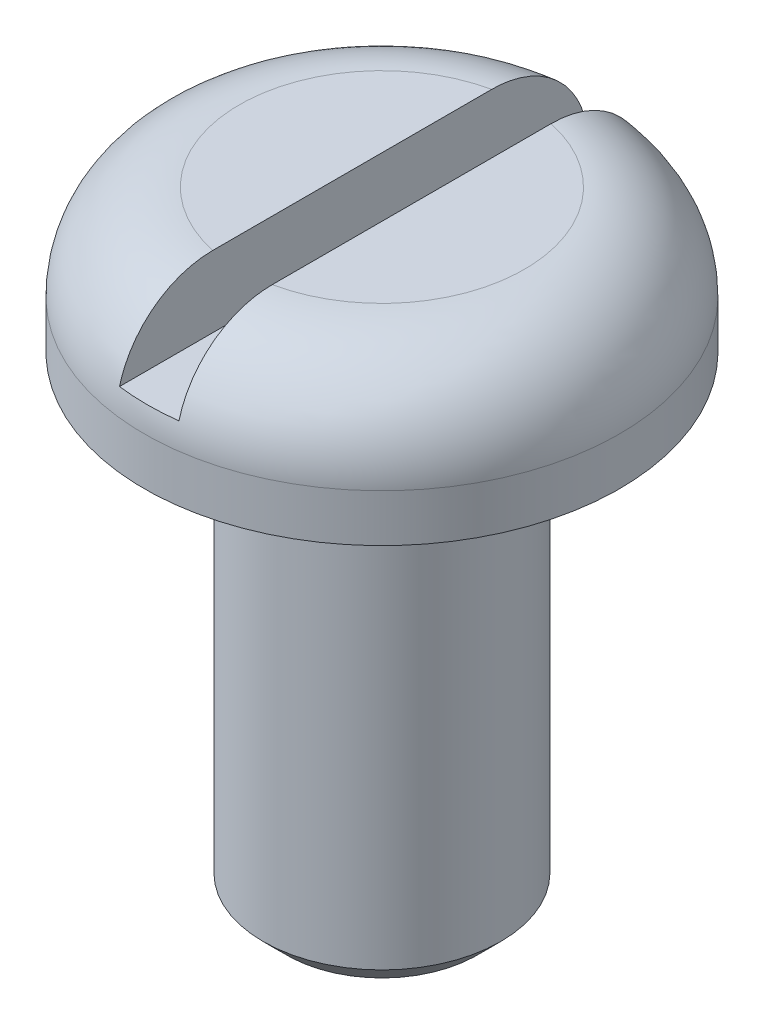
ISO-10303-21;
HEADER;
FILE_DESCRIPTION(('STEP AP214'),'2;1');
FILE_NAME('part.step','',(''),(''),'','','');
FILE_SCHEMA(('AUTOMOTIVE_DESIGN { 1 0 10303 214 1 1 1 1 }'));
ENDSEC;
DATA;
#1=APPLICATION_CONTEXT('core data for automotive mechanical design processes');
#2=APPLICATION_PROTOCOL_DEFINITION('international standard','automotive_design',2000,#1);
#3=PRODUCT_CONTEXT('',#1,'mechanical');
#4=PRODUCT('Part','Part','',(#3));
#5=PRODUCT_RELATED_PRODUCT_CATEGORY('part','',(#4));
#6=PRODUCT_DEFINITION_FORMATION('','',#4);
#7=PRODUCT_DEFINITION_CONTEXT('part definition',#1,'design');
#8=PRODUCT_DEFINITION('design','',#6,#7);
#9=PRODUCT_DEFINITION_SHAPE('','',#8);
#10=(LENGTH_UNIT() NAMED_UNIT(*) SI_UNIT(.MILLI.,.METRE.));
#11=(NAMED_UNIT(*) PLANE_ANGLE_UNIT() SI_UNIT($,.RADIAN.));
#12=(NAMED_UNIT(*) SI_UNIT($,.STERADIAN.) SOLID_ANGLE_UNIT());
#13=UNCERTAINTY_MEASURE_WITH_UNIT(LENGTH_MEASURE(1.E-05),#10,'distance_accuracy_value','');
#14=(GEOMETRIC_REPRESENTATION_CONTEXT(3) GLOBAL_UNCERTAINTY_ASSIGNED_CONTEXT((#13)) GLOBAL_UNIT_ASSIGNED_CONTEXT((#10,
#11,#12)) REPRESENTATION_CONTEXT('',''));
#15=CARTESIAN_POINT('',(0.,0.,0.));
#16=DIRECTION('',(0.,0.,1.));
#17=DIRECTION('',(1.,0.,0.));
#18=AXIS2_PLACEMENT_3D('',#15,#16,#17);
#19=CARTESIAN_POINT('',(0.,-4.,0.));
#20=DIRECTION('',(0.,1.,0.));
#21=DIRECTION('',(0.,0.,1.));
#22=AXIS2_PLACEMENT_3D('',#19,#20,#21);
#23=CYLINDRICAL_SURFACE('',#22,1.);
#24=CARTESIAN_POINT('',(0.,0.,0.));
#25=DIRECTION('',(0.,-1.,0.));
#26=DIRECTION('',(0.,0.,-1.));
#27=AXIS2_PLACEMENT_3D('',#24,#25,#26);
#28=CIRCLE('',#27,1.);
#29=CARTESIAN_POINT('',(0.,0.,-1.));
#30=VERTEX_POINT('',#29);
#31=EDGE_CURVE('E90',#30,#30,#28,.T.);
#32=ORIENTED_EDGE('',*,*,#31,.T.);
#33=EDGE_LOOP('',(#32));
#34=FACE_BOUND('',#33,.T.);
#35=CARTESIAN_POINT('',(0.,-3.8,0.));
#36=DIRECTION('',(0.,1.,0.));
#37=DIRECTION('',(0.,0.,1.));
#38=AXIS2_PLACEMENT_3D('',#35,#36,#37);
#39=CIRCLE('',#38,1.);
#40=CARTESIAN_POINT('',(0.,-3.8,1.));
#41=VERTEX_POINT('',#40);
#42=EDGE_CURVE('E169',#41,#41,#39,.F.);
#43=ORIENTED_EDGE('',*,*,#42,.F.);
#44=EDGE_LOOP('',(#43));
#45=FACE_BOUND('',#44,.T.);
#46=ADVANCED_FACE('F35',(#34,#45),#23,.T.);
#47=CARTESIAN_POINT('',(0.,1.2,0.));
#48=DIRECTION('',(0.,1.,0.));
#49=DIRECTION('',(0.,0.,1.));
#50=AXIS2_PLACEMENT_3D('',#47,#48,#49);
#51=PLANE('',#50);
#52=DIRECTION('',(0.,0.,1.));
#53=VECTOR('',#52,1.);
#54=CARTESIAN_POINT('',(-0.25,1.2,-2.92696320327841));
#55=LINE('',#54,#53);
#56=CARTESIAN_POINT('',(-0.25,1.2,-1.17366945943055));
#57=VERTEX_POINT('',#56);
#58=CARTESIAN_POINT('',(-0.25,1.2,1.17366945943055));
#59=VERTEX_POINT('',#58);
#60=EDGE_CURVE('E80',#57,#59,#55,.T.);
#61=ORIENTED_EDGE('',*,*,#60,.F.);
#62=CARTESIAN_POINT('',(0.,1.2,0.));
#63=DIRECTION('',(0.,-1.,0.));
#64=DIRECTION('',(0.,0.,-1.));
#65=AXIS2_PLACEMENT_3D('',#62,#63,#64);
#66=CIRCLE('',#65,1.19999999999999);
#67=EDGE_CURVE('E88',#59,#57,#66,.T.);
#68=ORIENTED_EDGE('',*,*,#67,.F.);
#69=EDGE_LOOP('',(#61,#68));
#70=FACE_BOUND('',#69,.T.);
#71=ADVANCED_FACE('F87',(#70),#51,.T.);
#72=CARTESIAN_POINT('',(0.,0.,0.));
#73=DIRECTION('',(0.,-1.,0.));
#74=DIRECTION('',(0.,0.,-1.));
#75=AXIS2_PLACEMENT_3D('',#72,#73,#74);
#76=PLANE('',#75);
#77=ORIENTED_EDGE('',*,*,#31,.F.);
#78=EDGE_LOOP('',(#77));
#79=FACE_BOUND('',#78,.T.);
#80=CARTESIAN_POINT('',(0.,0.,0.));
#81=DIRECTION('',(0.,-1.,0.));
#82=DIRECTION('',(0.,0.,-1.));
#83=AXIS2_PLACEMENT_3D('',#80,#81,#82);
#84=CIRCLE('',#83,2.);
#85=CARTESIAN_POINT('',(0.,0.,-2.));
#86=VERTEX_POINT('',#85);
#87=EDGE_CURVE('E102',#86,#86,#84,.T.);
#88=ORIENTED_EDGE('',*,*,#87,.T.);
#89=EDGE_LOOP('',(#88));
#90=FACE_BOUND('',#89,.T.);
#91=ADVANCED_FACE('F37',(#79,#90),#76,.T.);
#92=DIRECTION('',(0.,0.,-1.));
#93=VECTOR('',#92,1.);
#94=CARTESIAN_POINT('',(0.25,1.2,-2.92696320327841));
#95=LINE('',#94,#93);
#96=CARTESIAN_POINT('',(0.25,1.2,1.17366945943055));
#97=VERTEX_POINT('',#96);
#98=CARTESIAN_POINT('',(0.25,1.2,-1.17366945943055));
#99=VERTEX_POINT('',#98);
#100=EDGE_CURVE('E89',#97,#99,#95,.T.);
#101=ORIENTED_EDGE('',*,*,#100,.F.);
#102=EDGE_CURVE('E96',#99,#97,#66,.T.);
#103=ORIENTED_EDGE('',*,*,#102,.F.);
#104=EDGE_LOOP('',(#101,#103));
#105=FACE_BOUND('',#104,.T.);
#106=ADVANCED_FACE('F137',(#105),#51,.T.);
#107=CARTESIAN_POINT('',(0.,0.400000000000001,0.));
#108=DIRECTION('',(0.,-1.,0.));
#109=DIRECTION('',(0.,0.,-1.));
#110=AXIS2_PLACEMENT_3D('',#107,#108,#109);
#111=TOROIDAL_SURFACE('',#110,1.2,0.799999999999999);
#112=CARTESIAN_POINT('',(-0.25,0.929043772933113,-1.78264916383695));
#113=CARTESIAN_POINT('',(-0.25,0.962908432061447,-1.75249914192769));
#114=CARTESIAN_POINT('',(-0.25,0.994226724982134,-1.71944408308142));
#115=CARTESIAN_POINT('',(-0.25,1.05086576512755,-1.64850414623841));
#116=CARTESIAN_POINT('',(-0.25,1.07617978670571,-1.61061392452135));
#117=CARTESIAN_POINT('',(-0.25,1.12008106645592,-1.53116508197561));
#118=CARTESIAN_POINT('',(-0.25,1.13867473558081,-1.48961000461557));
#119=CARTESIAN_POINT('',(-0.25,1.16869832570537,-1.40400374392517));
#120=CARTESIAN_POINT('',(-0.25,1.18012981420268,-1.35995310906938));
#121=CARTESIAN_POINT('',(-0.25,1.1956846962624,-1.27008503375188));
#122=CARTESIAN_POINT('',(-0.25,1.19972662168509,-1.22425352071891));
#123=CARTESIAN_POINT('',(-0.25,1.20024660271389,-1.13254866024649));
#124=CARTESIAN_POINT('',(-0.25,1.19672351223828,-1.08667530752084));
#125=CARTESIAN_POINT('',(-0.25,1.1821569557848,-0.995009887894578));
#126=CARTESIAN_POINT('',(-0.25,1.17093464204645,-0.949246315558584));
#127=CARTESIAN_POINT('',(-0.25,1.14124459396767,-0.860146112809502));
#128=CARTESIAN_POINT('',(-0.25,1.12277683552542,-0.816809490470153));
#129=CARTESIAN_POINT('',(-0.25,1.07841724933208,-0.732049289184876));
#130=CARTESIAN_POINT('',(-0.25,1.05227434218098,-0.690757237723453));
#131=CARTESIAN_POINT('',(-0.25,0.993692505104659,-0.612868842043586));
#132=CARTESIAN_POINT('',(-0.25,0.96124815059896,-0.576276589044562));
#133=CARTESIAN_POINT('',(-0.25,0.889381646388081,-0.507194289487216));
#134=CARTESIAN_POINT('',(-0.25,0.849712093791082,-0.474961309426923));
#135=CARTESIAN_POINT('',(-0.25,0.765415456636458,-0.417757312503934));
#136=CARTESIAN_POINT('',(-0.25,0.720791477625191,-0.392781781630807));
#137=CARTESIAN_POINT('',(-0.25,0.639147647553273,-0.356909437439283));
#138=CARTESIAN_POINT('',(-0.25,0.60298866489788,-0.344056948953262));
#139=CARTESIAN_POINT('',(-0.25,0.529091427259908,-0.324493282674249));
#140=CARTESIAN_POINT('',(-0.25,0.491357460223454,-0.317766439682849));
#141=CARTESIAN_POINT('',(-0.25,0.415073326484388,-0.311266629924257));
#142=CARTESIAN_POINT('',(-0.25,0.376519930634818,-0.311530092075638));
#143=CARTESIAN_POINT('',(-0.25,0.300072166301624,-0.31906392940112));
#144=CARTESIAN_POINT('',(-0.25,0.262178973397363,-0.326345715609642));
#145=CARTESIAN_POINT('',(-0.25,0.182721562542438,-0.348502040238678));
#146=CARTESIAN_POINT('',(-0.25,0.141428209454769,-0.364329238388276));
#147=CARTESIAN_POINT('',(-0.25,0.0619486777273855,-0.402452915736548));
#148=CARTESIAN_POINT('',(-0.25,0.02376648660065,-0.424757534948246));
#149=CARTESIAN_POINT('',(-0.25,-0.0493517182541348,-0.475112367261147));
#150=CARTESIAN_POINT('',(-0.25,-0.0842367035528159,-0.503236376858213));
#151=CARTESIAN_POINT('',(-0.25,-0.149509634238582,-0.564252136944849));
#152=CARTESIAN_POINT('',(-0.25,-0.179899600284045,-0.59714173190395));
#153=CARTESIAN_POINT('',(-0.25,-0.239501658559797,-0.672016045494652));
#154=CARTESIAN_POINT('',(-0.25,-0.267930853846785,-0.714629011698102));
#155=CARTESIAN_POINT('',(-0.25,-0.317091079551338,-0.804112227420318));
#156=CARTESIAN_POINT('',(-0.25,-0.33781953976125,-0.850983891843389));
#157=CARTESIAN_POINT('',(-0.25,-0.370439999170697,-0.94678227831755));
#158=CARTESIAN_POINT('',(-0.25,-0.382483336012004,-0.995657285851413));
#159=CARTESIAN_POINT('',(-0.25,-0.397767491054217,-1.09476387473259));
#160=CARTESIAN_POINT('',(-0.25,-0.401010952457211,-1.14499504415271));
#161=CARTESIAN_POINT('',(-0.25,-0.398496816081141,-1.24296588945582));
#162=CARTESIAN_POINT('',(-0.25,-0.393137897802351,-1.290715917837));
#163=CARTESIAN_POINT('',(-0.25,-0.374208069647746,-1.38456108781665));
#164=CARTESIAN_POINT('',(-0.25,-0.360638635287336,-1.43065652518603));
#165=CARTESIAN_POINT('',(-0.25,-0.326181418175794,-1.51833026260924));
#166=CARTESIAN_POINT('',(-0.25,-0.30554041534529,-1.56000565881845));
#167=CARTESIAN_POINT('',(-0.25,-0.257425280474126,-1.63920597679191));
#168=CARTESIAN_POINT('',(-0.25,-0.229951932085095,-1.67673137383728));
#169=CARTESIAN_POINT('',(-0.25,-0.16952833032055,-1.74582898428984));
#170=CARTESIAN_POINT('',(-0.25,-0.136691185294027,-1.77750015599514));
#171=CARTESIAN_POINT('',(-0.25,-0.0661157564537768,-1.83480715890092));
#172=CARTESIAN_POINT('',(-0.25,-0.0283777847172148,-1.86044337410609));
#173=CARTESIAN_POINT('',(-0.25,0.0504874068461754,-1.90467489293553));
#174=CARTESIAN_POINT('',(-0.25,0.0915739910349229,-1.92334267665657));
#175=CARTESIAN_POINT('',(-0.25,0.17630826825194,-1.9534710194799));
#176=CARTESIAN_POINT('',(-0.25,0.219955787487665,-1.96493206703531));
#177=CARTESIAN_POINT('',(-0.25,0.308309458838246,-1.98026631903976));
#178=CARTESIAN_POINT('',(-0.25,0.353008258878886,-1.98418192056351));
#179=CARTESIAN_POINT('',(-0.25,0.442437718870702,-1.98443851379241));
#180=CARTESIAN_POINT('',(-0.25,0.487168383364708,-1.9807780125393));
#181=CARTESIAN_POINT('',(-0.25,0.575312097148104,-1.96599980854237));
#182=CARTESIAN_POINT('',(-0.25,0.618726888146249,-1.95489245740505));
#183=CARTESIAN_POINT('',(-0.25,0.703045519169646,-1.9255595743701));
#184=CARTESIAN_POINT('',(-0.25,0.74395193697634,-1.90734149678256));
#185=CARTESIAN_POINT('',(-0.25,0.809198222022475,-1.87145179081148));
#186=CARTESIAN_POINT('',(-0.25,0.83454905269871,-1.85558520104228));
#187=CARTESIAN_POINT('',(-0.25,0.883316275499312,-1.82111578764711));
#188=CARTESIAN_POINT('',(-0.25,0.906732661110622,-1.8025129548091));
#189=CARTESIAN_POINT('',(-0.25,0.929043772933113,-1.78264916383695));
#190=B_SPLINE_CURVE_WITH_KNOTS('',3,(#112,#113,#114,#115,#116,#117,#118,#119,#120,#121,#122,
#123,#124,#125,#126,#127,#128,#129,#130,#131,#132,#133,#134,#135,#136,#137,#138,#139,#140,#141,
#142,#143,#144,#145,#146,#147,#148,#149,#150,#151,#152,#153,#154,#155,#156,#157,#158,#159,#160,
#161,#162,#163,#164,#165,#166,#167,#168,#169,#170,#171,#172,#173,#174,#175,#176,#177,#178,#179,
#180,#181,#182,#183,#184,#185,#186,#187,#188,#189),.UNSPECIFIED.,.T.,.F.,(4,2,2,2,2,2,2,2,2,2,2,
2,2,2,2,2,2,2,2,2,2,2,2,2,2,2,2,2,2,2,2,2,2,2,2,2,2,2,4),(0.,0.135914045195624,
0.271979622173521,0.407915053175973,0.543820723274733,0.681215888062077,0.818631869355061,
0.959353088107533,1.10007477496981,1.24604202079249,1.39213548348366,1.54477087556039,
1.69731112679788,1.81199894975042,1.92639264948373,2.04138261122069,2.15655985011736,
2.28853898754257,2.4206847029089,2.55462199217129,2.68849888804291,2.84142524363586,
2.99440259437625,3.14464530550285,3.29484288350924,3.43827812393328,3.58168759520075,
3.72053078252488,3.85935805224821,3.99556615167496,4.13176558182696,4.26650605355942,
4.40123739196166,4.53520945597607,4.66920792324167,4.80302050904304,4.93669319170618,
5.02623737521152,5.11578186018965),.UNSPECIFIED.);
#191=CARTESIAN_POINT('',(-0.25,0.6,-1.95870671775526));
#192=VERTEX_POINT('',#191);
#193=EDGE_CURVE('E12',#192,#57,#190,.T.);
#194=ORIENTED_EDGE('',*,*,#193,.F.);
#195=CARTESIAN_POINT('',(0.,0.6,0.));
#196=DIRECTION('',(0.,1.,0.));
#197=DIRECTION('',(0.,0.,1.));
#198=AXIS2_PLACEMENT_3D('',#195,#196,#197);
#199=CIRCLE('',#198,1.97459666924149);
#200=CARTESIAN_POINT('',(0.25,0.6,-1.95870671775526));
#201=VERTEX_POINT('',#200);
#202=EDGE_CURVE('E108',#192,#201,#199,.F.);
#203=ORIENTED_EDGE('',*,*,#202,.T.);
#204=CARTESIAN_POINT('',(0.25,0.929043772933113,-1.78264916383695));
#205=CARTESIAN_POINT('',(0.25,0.895604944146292,-1.8124159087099));
#206=CARTESIAN_POINT('',(0.25,0.859651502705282,-1.83937956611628));
#207=CARTESIAN_POINT('',(0.25,0.783716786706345,-1.88690468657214));
#208=CARTESIAN_POINT('',(0.25,0.743733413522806,-1.90746279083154));
#209=CARTESIAN_POINT('',(0.25,0.660878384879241,-1.94156310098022));
#210=CARTESIAN_POINT('',(0.25,0.618006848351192,-1.9551055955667));
#211=CARTESIAN_POINT('',(0.25,0.530599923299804,-1.97477569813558));
#212=CARTESIAN_POINT('',(0.25,0.486064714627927,-1.98090410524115));
#213=CARTESIAN_POINT('',(0.25,0.396723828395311,-1.98556262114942));
#214=CARTESIAN_POINT('',(0.25,0.351919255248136,-1.98411392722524));
#215=CARTESIAN_POINT('',(0.25,0.26319034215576,-1.97370952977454));
#216=CARTESIAN_POINT('',(0.25,0.219266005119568,-1.9647538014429));
#217=CARTESIAN_POINT('',(0.25,0.133571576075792,-1.93960494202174));
#218=CARTESIAN_POINT('',(0.25,0.0918001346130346,-1.92341640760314));
#219=CARTESIAN_POINT('',(0.25,0.0115582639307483,-1.88427419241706));
#220=CARTESIAN_POINT('',(0.25,-0.0269121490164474,-1.86132047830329));
#221=CARTESIAN_POINT('',(0.25,-0.0995765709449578,-1.80924238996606));
#222=CARTESIAN_POINT('',(0.25,-0.133758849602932,-1.78010165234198));
#223=CARTESIAN_POINT('',(0.25,-0.196783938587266,-1.71652885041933));
#224=CARTESIAN_POINT('',(0.25,-0.225626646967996,-1.68209668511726));
#225=CARTESIAN_POINT('',(0.25,-0.277368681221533,-1.60868414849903));
#226=CARTESIAN_POINT('',(0.25,-0.300227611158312,-1.56967531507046));
#227=CARTESIAN_POINT('',(0.25,-0.339158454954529,-1.48840903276));
#228=CARTESIAN_POINT('',(0.25,-0.355230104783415,-1.44615145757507));
#229=CARTESIAN_POINT('',(0.25,-0.380357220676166,-1.35904964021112));
#230=CARTESIAN_POINT('',(0.25,-0.389325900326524,-1.31418038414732));
#231=CARTESIAN_POINT('',(0.25,-0.399761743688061,-1.22358137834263));
#232=CARTESIAN_POINT('',(0.25,-0.401228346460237,-1.1778515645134));
#233=CARTESIAN_POINT('',(0.25,-0.396681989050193,-1.08583445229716));
#234=CARTESIAN_POINT('',(0.25,-0.390516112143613,-1.03955476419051));
#235=CARTESIAN_POINT('',(0.25,-0.370751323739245,-0.94861728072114));
#236=CARTESIAN_POINT('',(0.25,-0.357151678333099,-0.90395964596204));
#237=CARTESIAN_POINT('',(0.25,-0.322467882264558,-0.815962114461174));
#238=CARTESIAN_POINT('',(0.25,-0.30115349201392,-0.772713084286));
#239=CARTESIAN_POINT('',(0.25,-0.251866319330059,-0.690187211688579));
#240=CARTESIAN_POINT('',(0.25,-0.223891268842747,-0.650911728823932));
#241=CARTESIAN_POINT('',(0.25,-0.160723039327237,-0.575591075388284));
#242=CARTESIAN_POINT('',(0.25,-0.125261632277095,-0.539770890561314));
#243=CARTESIAN_POINT('',(0.25,-0.0489018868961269,-0.474421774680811));
#244=CARTESIAN_POINT('',(0.25,-0.00800139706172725,-0.444895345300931));
#245=CARTESIAN_POINT('',(0.25,0.0709702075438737,-0.397774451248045));
#246=CARTESIAN_POINT('',(0.25,0.108339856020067,-0.379004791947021));
#247=CARTESIAN_POINT('',(0.25,0.185594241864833,-0.34774959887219));
#248=CARTESIAN_POINT('',(0.25,0.225473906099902,-0.335251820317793));
#249=CARTESIAN_POINT('',(0.25,0.307333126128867,-0.317782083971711));
#250=CARTESIAN_POINT('',(0.25,0.349329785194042,-0.312887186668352));
#251=CARTESIAN_POINT('',(0.25,0.433436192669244,-0.311731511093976));
#252=CARTESIAN_POINT('',(0.25,0.475545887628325,-0.315467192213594));
#253=CARTESIAN_POINT('',(0.25,0.552036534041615,-0.329727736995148));
#254=CARTESIAN_POINT('',(0.25,0.586633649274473,-0.339157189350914));
#255=CARTESIAN_POINT('',(0.25,0.654118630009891,-0.362896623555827));
#256=CARTESIAN_POINT('',(0.25,0.687004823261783,-0.377211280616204));
#257=CARTESIAN_POINT('',(0.25,0.755481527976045,-0.412459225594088));
#258=CARTESIAN_POINT('',(0.25,0.790722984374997,-0.43406791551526));
#259=CARTESIAN_POINT('',(0.25,0.857878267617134,-0.481933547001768));
#260=CARTESIAN_POINT('',(0.25,0.889791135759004,-0.508191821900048));
#261=CARTESIAN_POINT('',(0.25,0.955785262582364,-0.570428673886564));
#262=CARTESIAN_POINT('',(0.25,0.989029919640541,-0.607301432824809));
#263=CARTESIAN_POINT('',(0.25,1.04909237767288,-0.685973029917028));
#264=CARTESIAN_POINT('',(0.25,1.0759078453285,-0.727773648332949));
#265=CARTESIAN_POINT('',(0.25,1.12292614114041,-0.816602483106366));
#266=CARTESIAN_POINT('',(0.25,1.14290278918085,-0.863751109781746));
#267=CARTESIAN_POINT('',(0.25,1.17425935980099,-0.96082740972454));
#268=CARTESIAN_POINT('',(0.25,1.18564121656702,-1.01075445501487));
#269=CARTESIAN_POINT('',(0.25,1.19896890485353,-1.10969976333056));
#270=CARTESIAN_POINT('',(0.25,1.20129408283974,-1.15866691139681));
#271=CARTESIAN_POINT('',(0.25,1.19733805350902,-1.2562608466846));
#272=CARTESIAN_POINT('',(0.25,1.19105762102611,-1.3048876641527));
#273=CARTESIAN_POINT('',(0.25,1.17038371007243,-1.39840933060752));
#274=CARTESIAN_POINT('',(0.25,1.1563130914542,-1.44337578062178));
#275=CARTESIAN_POINT('',(0.25,1.12063994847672,-1.53019289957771));
#276=CARTESIAN_POINT('',(0.25,1.09904319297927,-1.57204592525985));
#277=CARTESIAN_POINT('',(0.25,1.05396957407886,-1.64338550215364));
#278=CARTESIAN_POINT('',(0.25,1.0317400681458,-1.67366810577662));
#279=CARTESIAN_POINT('',(0.25,0.983275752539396,-1.73083841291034));
#280=CARTESIAN_POINT('',(0.25,0.957041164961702,-1.75772630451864));
#281=CARTESIAN_POINT('',(0.25,0.929043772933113,-1.78264916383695));
#282=B_SPLINE_CURVE_WITH_KNOTS('',3,(#204,#205,#206,#207,#208,#209,#210,#211,#212,#213,#214,
#215,#216,#217,#218,#219,#220,#221,#222,#223,#224,#225,#226,#227,#228,#229,#230,#231,#232,#233,
#234,#235,#236,#237,#238,#239,#240,#241,#242,#243,#244,#245,#246,#247,#248,#249,#250,#251,#252,
#253,#254,#255,#256,#257,#258,#259,#260,#261,#262,#263,#264,#265,#266,#267,#268,#269,#270,#271,
#272,#273,#274,#275,#276,#277,#278,#279,#280,#281),.UNSPECIFIED.,.T.,.F.,(4,2,2,2,2,2,2,2,2,2,2,
2,2,2,2,2,2,2,2,2,2,2,2,2,2,2,2,2,2,2,2,2,2,2,2,2,2,2,4),(0.,0.134171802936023,
0.268413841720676,0.402650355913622,0.536872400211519,0.670719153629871,0.804566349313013,
0.938328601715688,1.07209151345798,1.20621270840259,1.34033646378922,1.47534359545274,
1.61035597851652,1.74699357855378,1.88364139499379,2.02307181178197,2.1625159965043,
2.30652081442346,2.45057473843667,2.60111298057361,2.75171094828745,2.87670133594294,
3.001446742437,3.12744846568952,3.25339850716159,3.36056785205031,3.46784004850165,
3.59142216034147,3.71503976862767,3.86330803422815,4.0116300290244,4.16446774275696,
4.31727105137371,4.46360053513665,4.60991684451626,4.75057958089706,4.89113473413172,
5.00347924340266,5.11581752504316),.UNSPECIFIED.);
#283=EDGE_CURVE('E47',#99,#201,#282,.T.);
#284=ORIENTED_EDGE('',*,*,#283,.F.);
#285=ORIENTED_EDGE('',*,*,#102,.T.);
#286=CARTESIAN_POINT('',(0.25,0.587541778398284,0.340340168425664));
#287=CARTESIAN_POINT('',(0.25,0.552094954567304,0.329737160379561));
#288=CARTESIAN_POINT('',(0.25,0.515796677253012,0.32189277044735));
#289=CARTESIAN_POINT('',(0.25,0.442400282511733,0.312619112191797));
#290=CARTESIAN_POINT('',(0.25,0.405302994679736,0.311183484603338));
#291=CARTESIAN_POINT('',(0.25,0.331898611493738,0.314894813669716));
#292=CARTESIAN_POINT('',(0.25,0.29558737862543,0.319962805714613));
#293=CARTESIAN_POINT('',(0.25,0.224235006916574,0.335907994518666));
#294=CARTESIAN_POINT('',(0.25,0.189196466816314,0.346796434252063));
#295=CARTESIAN_POINT('',(0.25,0.11126916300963,0.377292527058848));
#296=CARTESIAN_POINT('',(0.25,0.0690114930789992,0.398505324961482));
#297=CARTESIAN_POINT('',(0.25,-0.0114943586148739,0.447493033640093));
#298=CARTESIAN_POINT('',(0.25,-0.049739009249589,0.475273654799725));
#299=CARTESIAN_POINT('',(0.25,-0.121870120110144,0.53673721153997));
#300=CARTESIAN_POINT('',(0.25,-0.155704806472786,0.570480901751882));
#301=CARTESIAN_POINT('',(0.25,-0.217692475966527,0.642809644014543));
#302=CARTESIAN_POINT('',(0.25,-0.245847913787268,0.681392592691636));
#303=CARTESIAN_POINT('',(0.25,-0.297553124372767,0.765584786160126));
#304=CARTESIAN_POINT('',(0.25,-0.320602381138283,0.811503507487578));
#305=CARTESIAN_POINT('',(0.25,-0.358328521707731,0.906679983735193));
#306=CARTESIAN_POINT('',(0.25,-0.373004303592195,0.955938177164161));
#307=CARTESIAN_POINT('',(0.25,-0.392931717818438,1.05441477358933));
#308=CARTESIAN_POINT('',(0.25,-0.39851474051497,1.10356600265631));
#309=CARTESIAN_POINT('',(0.25,-0.400966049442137,1.20208433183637));
#310=CARTESIAN_POINT('',(0.25,-0.397836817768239,1.25145136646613));
#311=CARTESIAN_POINT('',(0.25,-0.383149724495,1.3468150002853));
#312=CARTESIAN_POINT('',(0.25,-0.371947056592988,1.39286644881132));
#313=CARTESIAN_POINT('',(0.25,-0.341757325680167,1.48234416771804));
#314=CARTESIAN_POINT('',(0.25,-0.32277145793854,1.52577084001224));
#315=CARTESIAN_POINT('',(0.25,-0.278129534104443,1.60755316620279));
#316=CARTESIAN_POINT('',(0.249999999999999,-0.252663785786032,1.64601278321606));
#317=CARTESIAN_POINT('',(0.249999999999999,-0.195542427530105,1.71802257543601));
#318=CARTESIAN_POINT('',(0.249999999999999,-0.163887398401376,1.75157321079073));
#319=CARTESIAN_POINT('',(0.249999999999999,-0.0958248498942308,1.81227698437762));
#320=CARTESIAN_POINT('',(0.249999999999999,-0.0594982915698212,1.83952093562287));
#321=CARTESIAN_POINT('',(0.249999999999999,0.0172454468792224,1.88746075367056));
#322=CARTESIAN_POINT('',(0.249999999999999,0.0576624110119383,1.90815696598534));
#323=CARTESIAN_POINT('',(0.249999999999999,0.1410625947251,1.94223789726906));
#324=CARTESIAN_POINT('',(0.249999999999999,0.184020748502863,1.95568397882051));
#325=CARTESIAN_POINT('',(0.249999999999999,0.271589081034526,1.97514020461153));
#326=CARTESIAN_POINT('',(0.249999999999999,0.316199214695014,1.98115055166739));
#327=CARTESIAN_POINT('',(0.249999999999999,0.405610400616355,1.98554962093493));
#328=CARTESIAN_POINT('',(0.249999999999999,0.450409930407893,1.98396935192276));
#329=CARTESIAN_POINT('',(0.249999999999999,0.539106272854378,1.9733048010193));
#330=CARTESIAN_POINT('',(0.249999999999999,0.583003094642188,1.96422059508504));
#331=CARTESIAN_POINT('',(0.249999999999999,0.668622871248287,1.93882120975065));
#332=CARTESIAN_POINT('',(0.249999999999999,0.710347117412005,1.92251038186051));
#333=CARTESIAN_POINT('',(0.249999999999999,0.790474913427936,1.88313341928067));
#334=CARTESIAN_POINT('',(0.249999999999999,0.828878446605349,1.86006725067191));
#335=CARTESIAN_POINT('',(0.249999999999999,0.901392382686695,1.80777622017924));
#336=CARTESIAN_POINT('',(0.249999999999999,0.935490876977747,1.77853484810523));
#337=CARTESIAN_POINT('',(0.249999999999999,0.998333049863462,1.71477633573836));
#338=CARTESIAN_POINT('',(0.25,1.0270766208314,1.68025908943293));
#339=CARTESIAN_POINT('',(0.25,1.07860838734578,1.60669231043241));
#340=CARTESIAN_POINT('',(0.25,1.1013558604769,1.56761426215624));
#341=CARTESIAN_POINT('',(0.25,1.140054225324,1.48622924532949));
#342=CARTESIAN_POINT('',(0.25,1.1560048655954,1.44392215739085));
#343=CARTESIAN_POINT('',(0.25,1.1808833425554,1.35673933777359));
#344=CARTESIAN_POINT('',(0.25,1.18972394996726,1.31183873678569));
#345=CARTESIAN_POINT('',(0.25,1.19990105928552,1.22119790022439));
#346=CARTESIAN_POINT('',(0.25,1.20123688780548,1.17545758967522));
#347=CARTESIAN_POINT('',(0.25,1.196427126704,1.08343510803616));
#348=CARTESIAN_POINT('',(0.25,1.19012771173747,1.03716103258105));
#349=CARTESIAN_POINT('',(0.25,1.17009994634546,0.94625982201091));
#350=CARTESIAN_POINT('',(0.25,1.15637145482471,0.901632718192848));
#351=CARTESIAN_POINT('',(0.25,1.12143450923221,0.813718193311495));
#352=CARTESIAN_POINT('',(0.25,1.09999627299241,0.770522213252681));
#353=CARTESIAN_POINT('',(0.25,1.05046309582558,0.688104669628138));
#354=CARTESIAN_POINT('',(0.25,1.02236342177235,0.648885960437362));
#355=CARTESIAN_POINT('',(0.25,0.958932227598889,0.573680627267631));
#356=CARTESIAN_POINT('',(0.25,0.923329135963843,0.537923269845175));
#357=CARTESIAN_POINT('',(0.25,0.846737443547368,0.472774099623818));
#358=CARTESIAN_POINT('',(0.25,0.805754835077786,0.443375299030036));
#359=CARTESIAN_POINT('',(0.25,0.735027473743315,0.401475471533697));
#360=CARTESIAN_POINT('',(0.25,0.706605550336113,0.38671486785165));
#361=CARTESIAN_POINT('',(0.25,0.648181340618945,0.360730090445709));
#362=CARTESIAN_POINT('',(0.25,0.618179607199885,0.34950468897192));
#363=CARTESIAN_POINT('',(0.25,0.587541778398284,0.340340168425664));
#364=B_SPLINE_CURVE_WITH_KNOTS('',3,(#286,#287,#288,#289,#290,#291,#292,#293,#294,#295,#296,
#297,#298,#299,#300,#301,#302,#303,#304,#305,#306,#307,#308,#309,#310,#311,#312,#313,#314,#315,
#316,#317,#318,#319,#320,#321,#322,#323,#324,#325,#326,#327,#328,#329,#330,#331,#332,#333,#334,
#335,#336,#337,#338,#339,#340,#341,#342,#343,#344,#345,#346,#347,#348,#349,#350,#351,#352,#353,
#354,#355,#356,#357,#358,#359,#360,#361,#362,#363),.UNSPECIFIED.,.T.,.F.,(4,2,2,2,2,2,2,2,2,2,2,
2,2,2,2,2,2,2,2,2,2,2,2,2,2,2,2,2,2,2,2,2,2,2,2,2,2,2,4),(0.,0.110891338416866,
0.221672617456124,0.33112147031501,0.440782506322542,0.581898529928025,0.72313770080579,
0.865908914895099,1.00861828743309,1.16197773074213,1.31535735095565,1.46301061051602,
1.61062180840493,1.75210686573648,1.89357020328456,2.03128080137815,2.16897848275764,
2.3045492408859,2.44011284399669,2.57451031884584,2.70890412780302,2.84274938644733,
2.97659329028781,3.11035670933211,3.24412080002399,3.37824715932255,3.51237621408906,
3.64739401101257,3.78241680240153,3.91907187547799,4.05573921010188,4.1952063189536,
4.33467607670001,4.47870368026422,4.62283392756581,4.77354357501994,4.92408674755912,
5.01996702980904,5.115813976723),.UNSPECIFIED.);
#365=CARTESIAN_POINT('',(0.249999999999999,0.6,1.95870671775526));
#366=VERTEX_POINT('',#365);
#367=EDGE_CURVE('E107',#366,#97,#364,.T.);
#368=ORIENTED_EDGE('',*,*,#367,.F.);
#369=CARTESIAN_POINT('',(-0.249999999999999,0.6,1.95870671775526));
#370=VERTEX_POINT('',#369);
#371=EDGE_CURVE('E100',#366,#370,#199,.F.);
#372=ORIENTED_EDGE('',*,*,#371,.T.);
#373=CARTESIAN_POINT('',(-0.25,0.587541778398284,0.340340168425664));
#374=CARTESIAN_POINT('',(-0.25,0.629424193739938,0.352870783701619));
#375=CARTESIAN_POINT('',(-0.25,0.670171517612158,0.36926495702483));
#376=CARTESIAN_POINT('',(-0.25,0.748566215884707,0.408334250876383));
#377=CARTESIAN_POINT('',(-0.25,0.786206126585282,0.431023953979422));
#378=CARTESIAN_POINT('',(-0.25,0.858861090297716,0.482464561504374));
#379=CARTESIAN_POINT('',(-0.25,0.893758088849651,0.511382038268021));
#380=CARTESIAN_POINT('',(-0.25,0.958883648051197,0.574022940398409));
#381=CARTESIAN_POINT('',(-0.25,0.989114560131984,0.607743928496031));
#382=CARTESIAN_POINT('',(-0.25,1.04786028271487,0.684013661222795));
#383=CARTESIAN_POINT('',(-0.25,1.0756309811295,0.727140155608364));
#384=CARTESIAN_POINT('',(-0.25,1.12336328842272,0.81754077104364));
#385=CARTESIAN_POINT('',(-0.25,1.14332287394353,0.864815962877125));
#386=CARTESIAN_POINT('',(-0.25,1.17427543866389,0.96111356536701));
#387=CARTESIAN_POINT('',(-0.25,1.18545040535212,1.01007728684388));
#388=CARTESIAN_POINT('',(-0.25,1.19899897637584,1.10920800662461));
#389=CARTESIAN_POINT('',(-0.25,1.20137498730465,1.15937467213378));
#390=CARTESIAN_POINT('',(-0.25,1.19719595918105,1.25708239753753));
#391=CARTESIAN_POINT('',(-0.25,1.19103588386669,1.30464047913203));
#392=CARTESIAN_POINT('',(-0.25,1.1705558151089,1.39796706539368));
#393=CARTESIAN_POINT('',(-0.25,1.15623733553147,1.44373590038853));
#394=CARTESIAN_POINT('',(-0.25,1.12036815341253,1.53067979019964));
#395=CARTESIAN_POINT('',(-0.25,1.09905616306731,1.57195343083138));
#396=CARTESIAN_POINT('',(-0.25,1.04968113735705,1.65024387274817));
#397=CARTESIAN_POINT('',(-0.249999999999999,1.02161884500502,1.6872611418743));
#398=CARTESIAN_POINT('',(-0.249999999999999,0.960112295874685,1.75528020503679));
#399=CARTESIAN_POINT('',(-0.249999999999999,0.926776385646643,1.78638001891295));
#400=CARTESIAN_POINT('',(-0.249999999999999,0.855309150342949,1.84246995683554));
#401=CARTESIAN_POINT('',(-0.249999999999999,0.817178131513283,1.86746047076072));
#402=CARTESIAN_POINT('',(-0.249999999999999,0.737635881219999,1.9103596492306));
#403=CARTESIAN_POINT('',(-0.249999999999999,0.696262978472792,1.92833940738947));
#404=CARTESIAN_POINT('',(-0.249999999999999,0.611075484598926,1.95705550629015));
#405=CARTESIAN_POINT('',(-0.249999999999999,0.567260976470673,1.9677920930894));
#406=CARTESIAN_POINT('',(-0.249999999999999,0.478685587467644,1.98166779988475));
#407=CARTESIAN_POINT('',(-0.249999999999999,0.433931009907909,1.98484718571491));
#408=CARTESIAN_POINT('',(-0.249999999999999,0.344524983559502,1.98363358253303));
#409=CARTESIAN_POINT('',(-0.249999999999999,0.299873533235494,1.97924070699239));
#410=CARTESIAN_POINT('',(-0.249999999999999,0.212017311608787,1.96302473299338));
#411=CARTESIAN_POINT('',(-0.249999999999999,0.168810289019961,1.9512138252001));
#412=CARTESIAN_POINT('',(-0.249999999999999,0.0849878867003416,1.92051720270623));
#413=CARTESIAN_POINT('',(-0.249999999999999,0.0443725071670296,1.90163148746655));
#414=CARTESIAN_POINT('',(-0.249999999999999,-0.0331903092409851,1.85729697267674));
#415=CARTESIAN_POINT('',(-0.249999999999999,-0.0701316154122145,1.83183745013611));
#416=CARTESIAN_POINT('',(-0.249999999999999,-0.139243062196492,1.77510785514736));
#417=CARTESIAN_POINT('',(-0.249999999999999,-0.171413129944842,1.74383769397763));
#418=CARTESIAN_POINT('',(-0.249999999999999,-0.230260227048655,1.67620641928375));
#419=CARTESIAN_POINT('',(-0.25,-0.256907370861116,1.6398193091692));
#420=CARTESIAN_POINT('',(-0.25,-0.303783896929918,1.56312487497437));
#421=CARTESIAN_POINT('',(-0.25,-0.324013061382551,1.5228174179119));
#422=CARTESIAN_POINT('',(-0.25,-0.357715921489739,1.4389965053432));
#423=CARTESIAN_POINT('',(-0.25,-0.371119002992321,1.39545467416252));
#424=CARTESIAN_POINT('',(-0.25,-0.390558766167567,1.30676039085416));
#425=CARTESIAN_POINT('',(-0.25,-0.396595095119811,1.26160786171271));
#426=CARTESIAN_POINT('',(-0.25,-0.401270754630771,1.17013628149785));
#427=CARTESIAN_POINT('',(-0.25,-0.399779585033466,1.12381060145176));
#428=CARTESIAN_POINT('',(-0.25,-0.389261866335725,1.03202479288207));
#429=CARTESIAN_POINT('',(-0.25,-0.380234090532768,0.986564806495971));
#430=CARTESIAN_POINT('',(-0.25,-0.354659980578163,0.896405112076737));
#431=CARTESIAN_POINT('',(-0.25,-0.337905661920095,0.851764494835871));
#432=CARTESIAN_POINT('',(-0.25,-0.29744354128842,0.765774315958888));
#433=CARTESIAN_POINT('',(-0.25,-0.273736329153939,0.72442447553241));
#434=CARTESIAN_POINT('',(-0.25,-0.218997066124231,0.64432498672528));
#435=CARTESIAN_POINT('',(-0.25,-0.187700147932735,0.605756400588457));
#436=CARTESIAN_POINT('',(-0.25,-0.119239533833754,0.534118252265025));
#437=CARTESIAN_POINT('',(-0.25,-0.0820662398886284,0.501057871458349));
#438=CARTESIAN_POINT('',(-0.25,-0.00135313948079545,0.440399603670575));
#439=CARTESIAN_POINT('',(-0.25,0.0423678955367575,0.413041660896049));
#440=CARTESIAN_POINT('',(-0.25,0.134117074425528,0.366948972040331));
#441=CARTESIAN_POINT('',(-0.25,0.182133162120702,0.348190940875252));
#442=CARTESIAN_POINT('',(-0.25,0.266598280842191,0.325504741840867));
#443=CARTESIAN_POINT('',(-0.25,0.302311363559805,0.318841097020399));
#444=CARTESIAN_POINT('',(-0.25,0.374316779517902,0.311749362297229));
#445=CARTESIAN_POINT('',(-0.25,0.410607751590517,0.311308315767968));
#446=CARTESIAN_POINT('',(-0.25,0.470509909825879,0.315768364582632));
#447=CARTESIAN_POINT('',(-0.25,0.494268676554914,0.318917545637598));
#448=CARTESIAN_POINT('',(-0.25,0.541312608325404,0.327770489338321));
#449=CARTESIAN_POINT('',(-0.25,0.56459752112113,0.333475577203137));
#450=CARTESIAN_POINT('',(-0.25,0.587541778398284,0.340340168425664));
#451=B_SPLINE_CURVE_WITH_KNOTS('',3,(#373,#374,#375,#376,#377,#378,#379,#380,#381,#382,#383,
#384,#385,#386,#387,#388,#389,#390,#391,#392,#393,#394,#395,#396,#397,#398,#399,#400,#401,#402,
#403,#404,#405,#406,#407,#408,#409,#410,#411,#412,#413,#414,#415,#416,#417,#418,#419,#420,#421,
#422,#423,#424,#425,#426,#427,#428,#429,#430,#431,#432,#433,#434,#435,#436,#437,#438,#439,#440,
#441,#442,#443,#444,#445,#446,#447,#448,#449,#450),.UNSPECIFIED.,.T.,.F.,(4,2,2,2,2,2,2,2,2,2,2,
2,2,2,2,2,2,2,2,2,2,2,2,2,2,2,2,2,2,2,2,2,2,2,2,2,2,2,4),(0.,0.131060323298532,
0.262426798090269,0.397879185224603,0.53326308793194,0.686389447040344,0.839555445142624,
0.989457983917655,1.13931951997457,1.28247376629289,1.42560145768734,1.56427891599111,
1.70294111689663,1.83905587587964,1.97516194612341,2.10984949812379,2.24453247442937,
2.37849621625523,2.51245795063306,2.64620010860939,2.77994227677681,2.91390399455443,
3.0478677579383,3.18253851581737,3.31721384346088,3.45325541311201,3.58930349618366,
3.72771818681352,3.86615541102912,4.00855862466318,4.15094976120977,4.29929581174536,
4.44788671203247,4.60183537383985,4.75536470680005,4.86388250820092,4.97217432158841,
5.0439352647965,5.11573345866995),.UNSPECIFIED.);
#452=EDGE_CURVE('E95',#59,#370,#451,.T.);
#453=ORIENTED_EDGE('',*,*,#452,.F.);
#454=ORIENTED_EDGE('',*,*,#67,.T.);
#455=EDGE_LOOP('',(#194,#203,#284,#285,#368,#372,#453,#454));
#456=FACE_BOUND('',#455,.T.);
#457=CARTESIAN_POINT('',(0.,0.400000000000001,0.));
#458=DIRECTION('',(0.,-1.,0.));
#459=DIRECTION('',(0.,0.,-1.));
#460=AXIS2_PLACEMENT_3D('',#457,#458,#459);
#461=CIRCLE('',#460,2.);
#462=CARTESIAN_POINT('',(0.,0.400000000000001,-2.));
#463=VERTEX_POINT('',#462);
#464=EDGE_CURVE('E97',#463,#463,#461,.T.);
#465=ORIENTED_EDGE('',*,*,#464,.F.);
#466=EDGE_LOOP('',(#465));
#467=FACE_BOUND('',#466,.T.);
#468=ADVANCED_FACE('F92',(#456,#467),#111,.T.);
#469=CARTESIAN_POINT('',(0.,0.,0.));
#470=DIRECTION('',(0.,-1.,0.));
#471=DIRECTION('',(0.,0.,-1.));
#472=AXIS2_PLACEMENT_3D('',#469,#470,#471);
#473=CYLINDRICAL_SURFACE('',#472,2.);
#474=ORIENTED_EDGE('',*,*,#464,.T.);
#475=EDGE_LOOP('',(#474));
#476=FACE_BOUND('',#475,.T.);
#477=ORIENTED_EDGE('',*,*,#87,.F.);
#478=EDGE_LOOP('',(#477));
#479=FACE_BOUND('',#478,.T.);
#480=ADVANCED_FACE('F143',(#476,#479),#473,.T.);
#481=CARTESIAN_POINT('',(-0.25,0.6,-2.92696320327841));
#482=DIRECTION('',(-1.,0.,0.));
#483=DIRECTION('',(0.,0.,1.));
#484=AXIS2_PLACEMENT_3D('',#481,#482,#483);
#485=PLANE('',#484);
#486=ORIENTED_EDGE('',*,*,#193,.T.);
#487=ORIENTED_EDGE('',*,*,#60,.T.);
#488=ORIENTED_EDGE('',*,*,#452,.T.);
#489=DIRECTION('',(0.,0.,1.));
#490=VECTOR('',#489,1.);
#491=CARTESIAN_POINT('',(-0.25,0.6,-2.92696320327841));
#492=LINE('',#491,#490);
#493=EDGE_CURVE('E54',#192,#370,#492,.T.);
#494=ORIENTED_EDGE('',*,*,#493,.F.);
#495=EDGE_LOOP('',(#486,#487,#488,#494));
#496=FACE_BOUND('',#495,.T.);
#497=ADVANCED_FACE('F79',(#496),#485,.F.);
#498=CARTESIAN_POINT('',(0.25,0.6,-2.92696320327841));
#499=DIRECTION('',(1.,0.,0.));
#500=DIRECTION('',(0.,0.,-1.));
#501=AXIS2_PLACEMENT_3D('',#498,#499,#500);
#502=PLANE('',#501);
#503=ORIENTED_EDGE('',*,*,#283,.T.);
#504=DIRECTION('',(0.,0.,-1.));
#505=VECTOR('',#504,1.);
#506=CARTESIAN_POINT('',(0.25,0.6,-2.92696320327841));
#507=LINE('',#506,#505);
#508=EDGE_CURVE('E128',#366,#201,#507,.T.);
#509=ORIENTED_EDGE('',*,*,#508,.F.);
#510=ORIENTED_EDGE('',*,*,#367,.T.);
#511=ORIENTED_EDGE('',*,*,#100,.T.);
#512=EDGE_LOOP('',(#503,#509,#510,#511));
#513=FACE_BOUND('',#512,.T.);
#514=ADVANCED_FACE('F117',(#513),#502,.F.);
#515=CARTESIAN_POINT('',(0.,0.6,0.));
#516=DIRECTION('',(0.,1.,0.));
#517=DIRECTION('',(0.,0.,1.));
#518=AXIS2_PLACEMENT_3D('',#515,#516,#517);
#519=PLANE('',#518);
#520=ORIENTED_EDGE('',*,*,#493,.T.);
#521=ORIENTED_EDGE('',*,*,#371,.F.);
#522=ORIENTED_EDGE('',*,*,#508,.T.);
#523=ORIENTED_EDGE('',*,*,#202,.F.);
#524=EDGE_LOOP('',(#520,#521,#522,#523));
#525=FACE_BOUND('',#524,.T.);
#526=ADVANCED_FACE('F121',(#525),#519,.T.);
#527=CARTESIAN_POINT('',(0.,-4.,0.));
#528=DIRECTION('',(0.,1.,0.));
#529=DIRECTION('',(0.,0.,-1.));
#530=AXIS2_PLACEMENT_3D('',#527,#528,#529);
#531=CONICAL_SURFACE('',#530,0.8,0.78539816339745);
#532=CARTESIAN_POINT('',(0.,-4.,0.));
#533=DIRECTION('',(0.,-1.,0.));
#534=DIRECTION('',(0.,0.,-1.));
#535=AXIS2_PLACEMENT_3D('',#532,#533,#534);
#536=CIRCLE('',#535,0.8);
#537=CARTESIAN_POINT('',(0.,-4.,-0.8));
#538=VERTEX_POINT('',#537);
#539=EDGE_CURVE('E166',#538,#538,#536,.T.);
#540=ORIENTED_EDGE('',*,*,#539,.F.);
#541=EDGE_LOOP('',(#540));
#542=FACE_BOUND('',#541,.T.);
#543=ORIENTED_EDGE('',*,*,#42,.T.);
#544=EDGE_LOOP('',(#543));
#545=FACE_BOUND('',#544,.T.);
#546=ADVANCED_FACE('F156',(#542,#545),#531,.T.);
#547=CARTESIAN_POINT('',(0.,-4.,0.));
#548=DIRECTION('',(0.,-1.,0.));
#549=DIRECTION('',(0.,0.,-1.));
#550=AXIS2_PLACEMENT_3D('',#547,#548,#549);
#551=PLANE('',#550);
#552=ORIENTED_EDGE('',*,*,#539,.T.);
#553=EDGE_LOOP('',(#552));
#554=FACE_BOUND('',#553,.T.);
#555=ADVANCED_FACE('F153',(#554),#551,.T.);
#556=CLOSED_SHELL('',(#46,#71,#91,#106,#468,#480,#497,#514,#526,#546,#555));
#557=MANIFOLD_SOLID_BREP('B2',#556);
#558=ADVANCED_BREP_SHAPE_REPRESENTATION('',(#18,#557),#14);
#559=SHAPE_DEFINITION_REPRESENTATION(#9,#558);
ENDSEC;
END-ISO-10303-21;
